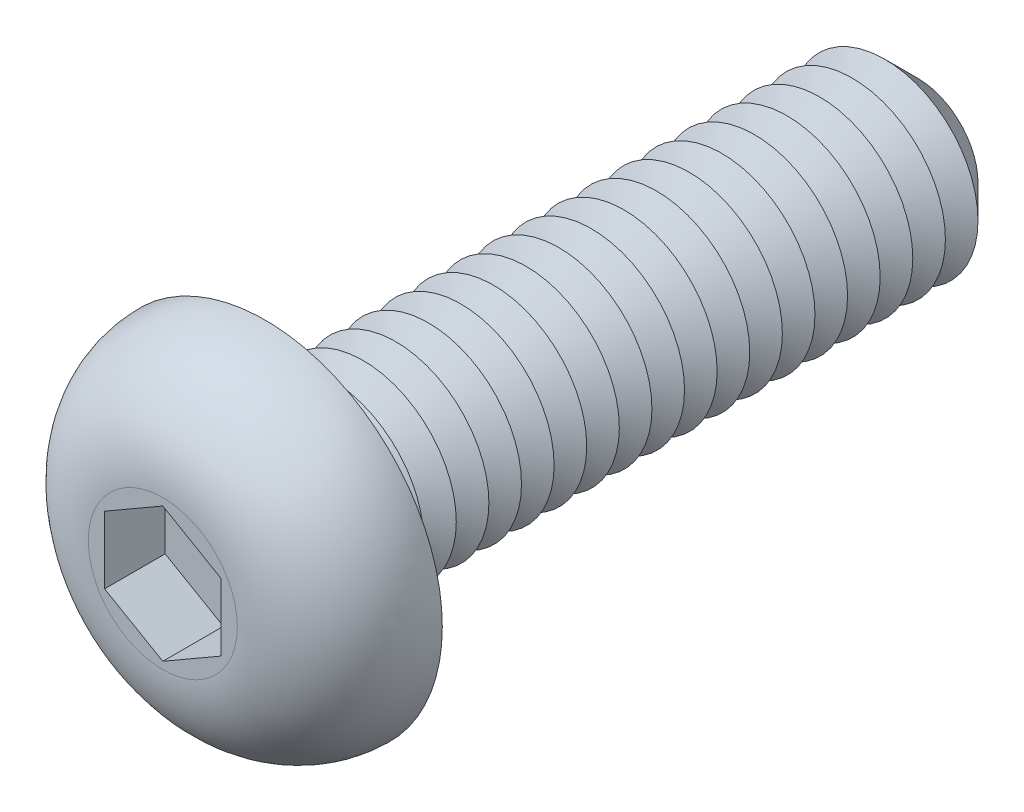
ISO-10303-21;
HEADER;
FILE_DESCRIPTION(('STEP AP214'),'2;1');
FILE_NAME('part.step','',(''),(''),'','','');
FILE_SCHEMA(('AUTOMOTIVE_DESIGN { 1 0 10303 214 1 1 1 1 }'));
ENDSEC;
DATA;
#1=APPLICATION_CONTEXT('core data for automotive mechanical design processes');
#2=APPLICATION_PROTOCOL_DEFINITION('international standard','automotive_design',2000,#1);
#3=PRODUCT_CONTEXT('',#1,'mechanical');
#4=PRODUCT('Part','Part','',(#3));
#5=PRODUCT_RELATED_PRODUCT_CATEGORY('part','',(#4));
#6=PRODUCT_DEFINITION_FORMATION('','',#4);
#7=PRODUCT_DEFINITION_CONTEXT('part definition',#1,'design');
#8=PRODUCT_DEFINITION('design','',#6,#7);
#9=PRODUCT_DEFINITION_SHAPE('','',#8);
#10=(LENGTH_UNIT() NAMED_UNIT(*) SI_UNIT(.MILLI.,.METRE.));
#11=(NAMED_UNIT(*) PLANE_ANGLE_UNIT() SI_UNIT($,.RADIAN.));
#12=(NAMED_UNIT(*) SI_UNIT($,.STERADIAN.) SOLID_ANGLE_UNIT());
#13=UNCERTAINTY_MEASURE_WITH_UNIT(LENGTH_MEASURE(1.E-05),#10,'distance_accuracy_value','');
#14=(GEOMETRIC_REPRESENTATION_CONTEXT(3) GLOBAL_UNCERTAINTY_ASSIGNED_CONTEXT((#13)) GLOBAL_UNIT_ASSIGNED_CONTEXT((#10,
#11,#12)) REPRESENTATION_CONTEXT('',''));
#15=CARTESIAN_POINT('',(0.,0.,0.));
#16=DIRECTION('',(0.,0.,1.));
#17=DIRECTION('',(1.,0.,0.));
#18=AXIS2_PLACEMENT_3D('',#15,#16,#17);
#19=CARTESIAN_POINT('',(0.,0.,-14.));
#20=DIRECTION('',(0.,0.,1.));
#21=DIRECTION('',(1.,0.,0.));
#22=AXIS2_PLACEMENT_3D('',#19,#20,#21);
#23=CYLINDRICAL_SURFACE('',#22,2.);
#24=CARTESIAN_POINT('',(0.,0.,-0.35));
#25=DIRECTION('',(0.,0.,1.));
#26=DIRECTION('',(1.,0.,0.));
#27=AXIS2_PLACEMENT_3D('',#24,#25,#26);
#28=CIRCLE('',#27,2.);
#29=CARTESIAN_POINT('',(2.,0.,-0.35));
#30=VERTEX_POINT('',#29);
#31=EDGE_CURVE('E48',#30,#30,#28,.F.);
#32=ORIENTED_EDGE('',*,*,#31,.T.);
#33=EDGE_LOOP('',(#32));
#34=FACE_BOUND('',#33,.T.);
#35=CARTESIAN_POINT('',(0.,0.,-0.699999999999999));
#36=DIRECTION('',(0.,0.,1.));
#37=DIRECTION('',(1.,0.,0.));
#38=AXIS2_PLACEMENT_3D('',#35,#36,#37);
#39=CIRCLE('',#38,2.);
#40=CARTESIAN_POINT('',(2.,0.,-0.699999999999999));
#41=VERTEX_POINT('',#40);
#42=EDGE_CURVE('E138',#41,#41,#39,.T.);
#43=ORIENTED_EDGE('',*,*,#42,.T.);
#44=EDGE_LOOP('',(#43));
#45=FACE_BOUND('',#44,.T.);
#46=ADVANCED_FACE('F39',(#34,#45),#23,.T.);
#47=CARTESIAN_POINT('',(0.,3.8,0.));
#48=DIRECTION('',(0.,0.,1.));
#49=DIRECTION('',(1.,0.,0.));
#50=AXIS2_PLACEMENT_3D('',#47,#48,#49);
#51=PLANE('',#50);
#52=CARTESIAN_POINT('',(0.,0.,0.));
#53=DIRECTION('',(0.,0.,1.));
#54=DIRECTION('',(1.,0.,0.));
#55=AXIS2_PLACEMENT_3D('',#52,#53,#54);
#56=CIRCLE('',#55,2.35);
#57=CARTESIAN_POINT('',(2.35,0.,0.));
#58=VERTEX_POINT('',#57);
#59=EDGE_CURVE('E11',#58,#58,#56,.T.);
#60=ORIENTED_EDGE('',*,*,#59,.T.);
#61=EDGE_LOOP('',(#60));
#62=FACE_BOUND('',#61,.T.);
#63=CARTESIAN_POINT('',(0.,0.,0.));
#64=DIRECTION('',(0.,0.,1.));
#65=DIRECTION('',(1.,0.,0.));
#66=AXIS2_PLACEMENT_3D('',#63,#64,#65);
#67=CIRCLE('',#66,3.8);
#68=CARTESIAN_POINT('',(3.8,0.,0.));
#69=VERTEX_POINT('',#68);
#70=EDGE_CURVE('E156',#69,#69,#67,.T.);
#71=ORIENTED_EDGE('',*,*,#70,.F.);
#72=EDGE_LOOP('',(#71));
#73=FACE_BOUND('',#72,.T.);
#74=ADVANCED_FACE('F198',(#62,#73),#51,.F.);
#75=CARTESIAN_POINT('',(0.,0.,2.2));
#76=DIRECTION('',(0.,0.,-1.));
#77=DIRECTION('',(-1.,0.,0.));
#78=AXIS2_PLACEMENT_3D('',#75,#76,#77);
#79=PLANE('',#78);
#80=DIRECTION('',(-0.866025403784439,-0.5,0.));
#81=VECTOR('',#80,1.);
#82=CARTESIAN_POINT('',(0.,1.44337567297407,2.2));
#83=LINE('',#82,#81);
#84=CARTESIAN_POINT('',(0.,1.44337567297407,2.2));
#85=VERTEX_POINT('',#84);
#86=CARTESIAN_POINT('',(-1.25,0.721687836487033,2.2));
#87=VERTEX_POINT('',#86);
#88=EDGE_CURVE('E137',#85,#87,#83,.T.);
#89=ORIENTED_EDGE('',*,*,#88,.F.);
#90=DIRECTION('',(-0.866025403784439,0.5,0.));
#91=VECTOR('',#90,1.);
#92=CARTESIAN_POINT('',(1.25,0.721687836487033,2.2));
#93=LINE('',#92,#91);
#94=CARTESIAN_POINT('',(1.25,0.721687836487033,2.2));
#95=VERTEX_POINT('',#94);
#96=EDGE_CURVE('E55',#95,#85,#93,.T.);
#97=ORIENTED_EDGE('',*,*,#96,.F.);
#98=DIRECTION('',(0.,1.,0.));
#99=VECTOR('',#98,1.);
#100=CARTESIAN_POINT('',(1.25,-0.721687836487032,2.2));
#101=LINE('',#100,#99);
#102=CARTESIAN_POINT('',(1.25,-0.721687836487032,2.2));
#103=VERTEX_POINT('',#102);
#104=EDGE_CURVE('E150',#103,#95,#101,.T.);
#105=ORIENTED_EDGE('',*,*,#104,.F.);
#106=DIRECTION('',(0.866025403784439,0.5,0.));
#107=VECTOR('',#106,1.);
#108=CARTESIAN_POINT('',(0.,-1.44337567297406,2.2));
#109=LINE('',#108,#107);
#110=CARTESIAN_POINT('',(0.,-1.44337567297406,2.2));
#111=VERTEX_POINT('',#110);
#112=EDGE_CURVE('E147',#111,#103,#109,.T.);
#113=ORIENTED_EDGE('',*,*,#112,.F.);
#114=DIRECTION('',(0.866025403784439,-0.5,0.));
#115=VECTOR('',#114,1.);
#116=CARTESIAN_POINT('',(-1.25,-0.721687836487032,2.2));
#117=LINE('',#116,#115);
#118=CARTESIAN_POINT('',(-1.25,-0.721687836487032,2.2));
#119=VERTEX_POINT('',#118);
#120=EDGE_CURVE('E103',#119,#111,#117,.T.);
#121=ORIENTED_EDGE('',*,*,#120,.F.);
#122=DIRECTION('',(0.,-1.,0.));
#123=VECTOR('',#122,1.);
#124=CARTESIAN_POINT('',(-1.25,0.721687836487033,2.2));
#125=LINE('',#124,#123);
#126=EDGE_CURVE('E141',#87,#119,#125,.T.);
#127=ORIENTED_EDGE('',*,*,#126,.F.);
#128=EDGE_LOOP('',(#89,#97,#105,#113,#121,#127));
#129=FACE_BOUND('',#128,.T.);
#130=CARTESIAN_POINT('',(0.,0.,2.2));
#131=DIRECTION('',(0.,0.,1.));
#132=DIRECTION('',(1.,0.,0.));
#133=AXIS2_PLACEMENT_3D('',#130,#131,#132);
#134=CIRCLE('',#133,1.6);
#135=CARTESIAN_POINT('',(1.6,0.,2.2));
#136=VERTEX_POINT('',#135);
#137=EDGE_CURVE('E169',#136,#136,#134,.T.);
#138=ORIENTED_EDGE('',*,*,#137,.T.);
#139=EDGE_LOOP('',(#138));
#140=FACE_BOUND('',#139,.T.);
#141=ADVANCED_FACE('F203',(#129,#140),#79,.F.);
#142=CARTESIAN_POINT('',(0.,0.,0.));
#143=DIRECTION('',(0.,0.,1.));
#144=DIRECTION('',(1.,0.,0.));
#145=AXIS2_PLACEMENT_3D('',#142,#143,#144);
#146=DEGENERATE_TOROIDAL_SURFACE('',#145,1.6,2.2,.T.);
#147=ORIENTED_EDGE('',*,*,#137,.F.);
#148=EDGE_LOOP('',(#147));
#149=FACE_BOUND('',#148,.T.);
#150=ORIENTED_EDGE('',*,*,#70,.T.);
#151=EDGE_LOOP('',(#150));
#152=FACE_BOUND('',#151,.T.);
#153=ADVANCED_FACE('F231',(#149,#152),#146,.T.);
#154=CARTESIAN_POINT('',(1.25,0.721687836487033,0.9));
#155=DIRECTION('',(0.5,0.866025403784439,0.));
#156=DIRECTION('',(-0.866025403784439,0.5,0.));
#157=AXIS2_PLACEMENT_3D('',#154,#155,#156);
#158=PLANE('',#157);
#159=ORIENTED_EDGE('',*,*,#96,.T.);
#160=DIRECTION('',(0.,0.,1.));
#161=VECTOR('',#160,1.);
#162=CARTESIAN_POINT('',(0.,1.44337567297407,0.9));
#163=LINE('',#162,#161);
#164=CARTESIAN_POINT('',(0.,1.44337567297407,0.9));
#165=VERTEX_POINT('',#164);
#166=EDGE_CURVE('E85',#165,#85,#163,.T.);
#167=ORIENTED_EDGE('',*,*,#166,.F.);
#168=DIRECTION('',(-0.866025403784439,0.5,0.));
#169=VECTOR('',#168,1.);
#170=CARTESIAN_POINT('',(1.25,0.721687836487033,0.9));
#171=LINE('',#170,#169);
#172=CARTESIAN_POINT('',(1.25,0.721687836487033,0.9));
#173=VERTEX_POINT('',#172);
#174=EDGE_CURVE('E153',#173,#165,#171,.T.);
#175=ORIENTED_EDGE('',*,*,#174,.F.);
#176=DIRECTION('',(0.,0.,1.));
#177=VECTOR('',#176,1.);
#178=CARTESIAN_POINT('',(1.25,0.721687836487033,0.9));
#179=LINE('',#178,#177);
#180=EDGE_CURVE('E63',#173,#95,#179,.T.);
#181=ORIENTED_EDGE('',*,*,#180,.T.);
#182=EDGE_LOOP('',(#159,#167,#175,#181));
#183=FACE_BOUND('',#182,.T.);
#184=ADVANCED_FACE('F217',(#183),#158,.F.);
#185=CARTESIAN_POINT('',(1.25,-0.721687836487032,0.9));
#186=DIRECTION('',(1.,0.,0.));
#187=DIRECTION('',(0.,1.,0.));
#188=AXIS2_PLACEMENT_3D('',#185,#186,#187);
#189=PLANE('',#188);
#190=ORIENTED_EDGE('',*,*,#104,.T.);
#191=ORIENTED_EDGE('',*,*,#180,.F.);
#192=DIRECTION('',(0.,1.,0.));
#193=VECTOR('',#192,1.);
#194=CARTESIAN_POINT('',(1.25,-0.721687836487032,0.9));
#195=LINE('',#194,#193);
#196=CARTESIAN_POINT('',(1.25,-0.721687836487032,0.9));
#197=VERTEX_POINT('',#196);
#198=EDGE_CURVE('E117',#197,#173,#195,.T.);
#199=ORIENTED_EDGE('',*,*,#198,.F.);
#200=DIRECTION('',(0.,0.,1.));
#201=VECTOR('',#200,1.);
#202=CARTESIAN_POINT('',(1.25,-0.721687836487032,0.9));
#203=LINE('',#202,#201);
#204=EDGE_CURVE('E108',#197,#103,#203,.T.);
#205=ORIENTED_EDGE('',*,*,#204,.T.);
#206=EDGE_LOOP('',(#190,#191,#199,#205));
#207=FACE_BOUND('',#206,.T.);
#208=ADVANCED_FACE('F214',(#207),#189,.F.);
#209=CARTESIAN_POINT('',(0.,-1.44337567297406,0.9));
#210=DIRECTION('',(0.5,-0.866025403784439,0.));
#211=DIRECTION('',(0.866025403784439,0.5,0.));
#212=AXIS2_PLACEMENT_3D('',#209,#210,#211);
#213=PLANE('',#212);
#214=ORIENTED_EDGE('',*,*,#112,.T.);
#215=ORIENTED_EDGE('',*,*,#204,.F.);
#216=DIRECTION('',(0.866025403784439,0.5,0.));
#217=VECTOR('',#216,1.);
#218=CARTESIAN_POINT('',(0.,-1.44337567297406,0.9));
#219=LINE('',#218,#217);
#220=CARTESIAN_POINT('',(0.,-1.44337567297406,0.9));
#221=VERTEX_POINT('',#220);
#222=EDGE_CURVE('E112',#221,#197,#219,.T.);
#223=ORIENTED_EDGE('',*,*,#222,.F.);
#224=DIRECTION('',(0.,0.,1.));
#225=VECTOR('',#224,1.);
#226=CARTESIAN_POINT('',(0.,-1.44337567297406,0.9));
#227=LINE('',#226,#225);
#228=EDGE_CURVE('E96',#221,#111,#227,.T.);
#229=ORIENTED_EDGE('',*,*,#228,.T.);
#230=EDGE_LOOP('',(#214,#215,#223,#229));
#231=FACE_BOUND('',#230,.T.);
#232=ADVANCED_FACE('F113',(#231),#213,.F.);
#233=CARTESIAN_POINT('',(-1.25,-0.721687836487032,0.9));
#234=DIRECTION('',(-0.5,-0.866025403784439,0.));
#235=DIRECTION('',(0.866025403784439,-0.5,0.));
#236=AXIS2_PLACEMENT_3D('',#233,#234,#235);
#237=PLANE('',#236);
#238=ORIENTED_EDGE('',*,*,#120,.T.);
#239=ORIENTED_EDGE('',*,*,#228,.F.);
#240=DIRECTION('',(0.866025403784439,-0.5,0.));
#241=VECTOR('',#240,1.);
#242=CARTESIAN_POINT('',(-1.25,-0.721687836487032,0.9));
#243=LINE('',#242,#241);
#244=CARTESIAN_POINT('',(-1.25,-0.721687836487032,0.9));
#245=VERTEX_POINT('',#244);
#246=EDGE_CURVE('E100',#245,#221,#243,.T.);
#247=ORIENTED_EDGE('',*,*,#246,.F.);
#248=DIRECTION('',(0.,0.,1.));
#249=VECTOR('',#248,1.);
#250=CARTESIAN_POINT('',(-1.25,-0.721687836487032,0.9));
#251=LINE('',#250,#249);
#252=EDGE_CURVE('E109',#245,#119,#251,.T.);
#253=ORIENTED_EDGE('',*,*,#252,.T.);
#254=EDGE_LOOP('',(#238,#239,#247,#253));
#255=FACE_BOUND('',#254,.T.);
#256=ADVANCED_FACE('F98',(#255),#237,.F.);
#257=CARTESIAN_POINT('',(-1.25,0.721687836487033,0.9));
#258=DIRECTION('',(-1.,0.,0.));
#259=DIRECTION('',(0.,-1.,0.));
#260=AXIS2_PLACEMENT_3D('',#257,#258,#259);
#261=PLANE('',#260);
#262=ORIENTED_EDGE('',*,*,#126,.T.);
#263=ORIENTED_EDGE('',*,*,#252,.F.);
#264=DIRECTION('',(0.,-1.,0.));
#265=VECTOR('',#264,1.);
#266=CARTESIAN_POINT('',(-1.25,0.721687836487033,0.9));
#267=LINE('',#266,#265);
#268=CARTESIAN_POINT('',(-1.25,0.721687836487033,0.9));
#269=VERTEX_POINT('',#268);
#270=EDGE_CURVE('E123',#269,#245,#267,.T.);
#271=ORIENTED_EDGE('',*,*,#270,.F.);
#272=DIRECTION('',(0.,0.,1.));
#273=VECTOR('',#272,1.);
#274=CARTESIAN_POINT('',(-1.25,0.721687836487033,0.9));
#275=LINE('',#274,#273);
#276=EDGE_CURVE('E161',#269,#87,#275,.T.);
#277=ORIENTED_EDGE('',*,*,#276,.T.);
#278=EDGE_LOOP('',(#262,#263,#271,#277));
#279=FACE_BOUND('',#278,.T.);
#280=ADVANCED_FACE('F222',(#279),#261,.F.);
#281=CARTESIAN_POINT('',(0.,1.44337567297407,0.9));
#282=DIRECTION('',(-0.5,0.866025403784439,0.));
#283=DIRECTION('',(-0.866025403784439,-0.5,0.));
#284=AXIS2_PLACEMENT_3D('',#281,#282,#283);
#285=PLANE('',#284);
#286=ORIENTED_EDGE('',*,*,#88,.T.);
#287=ORIENTED_EDGE('',*,*,#276,.F.);
#288=DIRECTION('',(-0.866025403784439,-0.5,0.));
#289=VECTOR('',#288,1.);
#290=CARTESIAN_POINT('',(0.,1.44337567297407,0.9));
#291=LINE('',#290,#289);
#292=EDGE_CURVE('E129',#165,#269,#291,.T.);
#293=ORIENTED_EDGE('',*,*,#292,.F.);
#294=ORIENTED_EDGE('',*,*,#166,.T.);
#295=EDGE_LOOP('',(#286,#287,#293,#294));
#296=FACE_BOUND('',#295,.T.);
#297=ADVANCED_FACE('F212',(#296),#285,.F.);
#298=CARTESIAN_POINT('',(0.,0.,0.9));
#299=DIRECTION('',(0.,0.,1.));
#300=DIRECTION('',(1.,0.,0.));
#301=AXIS2_PLACEMENT_3D('',#298,#299,#300);
#302=PLANE('',#301);
#303=CARTESIAN_POINT('',(0.,0.,0.9));
#304=DIRECTION('',(0.,0.,1.));
#305=DIRECTION('',(1.,0.,0.));
#306=AXIS2_PLACEMENT_3D('',#303,#304,#305);
#307=CIRCLE('',#306,0.5);
#308=CARTESIAN_POINT('',(0.5,0.,0.9));
#309=VERTEX_POINT('',#308);
#310=EDGE_CURVE('E399',#309,#309,#307,.T.);
#311=ORIENTED_EDGE('',*,*,#310,.F.);
#312=EDGE_LOOP('',(#311));
#313=FACE_BOUND('',#312,.T.);
#314=ORIENTED_EDGE('',*,*,#174,.T.);
#315=ORIENTED_EDGE('',*,*,#292,.T.);
#316=ORIENTED_EDGE('',*,*,#270,.T.);
#317=ORIENTED_EDGE('',*,*,#246,.T.);
#318=ORIENTED_EDGE('',*,*,#222,.T.);
#319=ORIENTED_EDGE('',*,*,#198,.T.);
#320=EDGE_LOOP('',(#314,#315,#316,#317,#318,#319));
#321=FACE_BOUND('',#320,.T.);
#322=ADVANCED_FACE('F120',(#313,#321),#302,.T.);
#323=CARTESIAN_POINT('',(0.,0.,-0.699999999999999));
#324=DIRECTION('',(0.,0.,1.));
#325=DIRECTION('',(1.,0.,0.));
#326=AXIS2_PLACEMENT_3D('',#323,#324,#325);
#327=CONICAL_SURFACE('',#326,2.,1.04719755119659);
#328=CARTESIAN_POINT('',(0.,0.,-1.05));
#329=DIRECTION('',(0.,0.,1.));
#330=DIRECTION('',(1.,0.,0.));
#331=AXIS2_PLACEMENT_3D('',#328,#329,#330);
#332=CIRCLE('',#331,1.39378221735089);
#333=CARTESIAN_POINT('',(1.39378221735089,0.,-1.05));
#334=VERTEX_POINT('',#333);
#335=EDGE_CURVE('E256',#334,#334,#332,.T.);
#336=ORIENTED_EDGE('',*,*,#335,.T.);
#337=EDGE_LOOP('',(#336));
#338=FACE_BOUND('',#337,.T.);
#339=ORIENTED_EDGE('',*,*,#42,.F.);
#340=EDGE_LOOP('',(#339));
#341=FACE_BOUND('',#340,.T.);
#342=ADVANCED_FACE('F211',(#338,#341),#327,.T.);
#343=CARTESIAN_POINT('',(0.,0.,-1.05));
#344=DIRECTION('',(0.,0.,-1.));
#345=DIRECTION('',(-1.,0.,0.));
#346=AXIS2_PLACEMENT_3D('',#343,#344,#345);
#347=CONICAL_SURFACE('',#346,1.39378221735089,1.0471975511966);
#348=CARTESIAN_POINT('',(0.,0.,-1.4));
#349=DIRECTION('',(0.,0.,1.));
#350=DIRECTION('',(1.,0.,0.));
#351=AXIS2_PLACEMENT_3D('',#348,#349,#350);
#352=CIRCLE('',#351,2.);
#353=CARTESIAN_POINT('',(2.,0.,-1.4));
#354=VERTEX_POINT('',#353);
#355=EDGE_CURVE('E260',#354,#354,#352,.T.);
#356=ORIENTED_EDGE('',*,*,#355,.T.);
#357=EDGE_LOOP('',(#356));
#358=FACE_BOUND('',#357,.T.);
#359=ORIENTED_EDGE('',*,*,#335,.F.);
#360=EDGE_LOOP('',(#359));
#361=FACE_BOUND('',#360,.T.);
#362=ADVANCED_FACE('F551',(#358,#361),#347,.T.);
#363=CARTESIAN_POINT('',(0.,0.,-1.4));
#364=DIRECTION('',(0.,0.,1.));
#365=DIRECTION('',(1.,0.,0.));
#366=AXIS2_PLACEMENT_3D('',#363,#364,#365);
#367=CONICAL_SURFACE('',#366,2.,1.04719755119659);
#368=CARTESIAN_POINT('',(0.,0.,-1.75));
#369=DIRECTION('',(0.,0.,1.));
#370=DIRECTION('',(1.,0.,0.));
#371=AXIS2_PLACEMENT_3D('',#368,#369,#370);
#372=CIRCLE('',#371,1.39378221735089);
#373=CARTESIAN_POINT('',(1.39378221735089,0.,-1.75));
#374=VERTEX_POINT('',#373);
#375=EDGE_CURVE('E264',#374,#374,#372,.T.);
#376=ORIENTED_EDGE('',*,*,#375,.T.);
#377=EDGE_LOOP('',(#376));
#378=FACE_BOUND('',#377,.T.);
#379=ORIENTED_EDGE('',*,*,#355,.F.);
#380=EDGE_LOOP('',(#379));
#381=FACE_BOUND('',#380,.T.);
#382=ADVANCED_FACE('F547',(#378,#381),#367,.T.);
#383=CARTESIAN_POINT('',(0.,0.,-1.75));
#384=DIRECTION('',(0.,0.,-1.));
#385=DIRECTION('',(-1.,0.,0.));
#386=AXIS2_PLACEMENT_3D('',#383,#384,#385);
#387=CONICAL_SURFACE('',#386,1.39378221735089,1.0471975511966);
#388=CARTESIAN_POINT('',(0.,0.,-2.1));
#389=DIRECTION('',(0.,0.,1.));
#390=DIRECTION('',(1.,0.,0.));
#391=AXIS2_PLACEMENT_3D('',#388,#389,#390);
#392=CIRCLE('',#391,2.);
#393=CARTESIAN_POINT('',(2.,0.,-2.1));
#394=VERTEX_POINT('',#393);
#395=EDGE_CURVE('E268',#394,#394,#392,.T.);
#396=ORIENTED_EDGE('',*,*,#395,.T.);
#397=EDGE_LOOP('',(#396));
#398=FACE_BOUND('',#397,.T.);
#399=ORIENTED_EDGE('',*,*,#375,.F.);
#400=EDGE_LOOP('',(#399));
#401=FACE_BOUND('',#400,.T.);
#402=ADVANCED_FACE('F543',(#398,#401),#387,.T.);
#403=CARTESIAN_POINT('',(0.,0.,-2.1));
#404=DIRECTION('',(0.,0.,1.));
#405=DIRECTION('',(1.,0.,0.));
#406=AXIS2_PLACEMENT_3D('',#403,#404,#405);
#407=CONICAL_SURFACE('',#406,2.,1.04719755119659);
#408=CARTESIAN_POINT('',(0.,0.,-2.45));
#409=DIRECTION('',(0.,0.,1.));
#410=DIRECTION('',(1.,0.,0.));
#411=AXIS2_PLACEMENT_3D('',#408,#409,#410);
#412=CIRCLE('',#411,1.39378221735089);
#413=CARTESIAN_POINT('',(1.39378221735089,0.,-2.45));
#414=VERTEX_POINT('',#413);
#415=EDGE_CURVE('E271',#414,#414,#412,.T.);
#416=ORIENTED_EDGE('',*,*,#415,.T.);
#417=EDGE_LOOP('',(#416));
#418=FACE_BOUND('',#417,.T.);
#419=ORIENTED_EDGE('',*,*,#395,.F.);
#420=EDGE_LOOP('',(#419));
#421=FACE_BOUND('',#420,.T.);
#422=ADVANCED_FACE('F539',(#418,#421),#407,.T.);
#423=CARTESIAN_POINT('',(0.,0.,-2.45));
#424=DIRECTION('',(0.,0.,-1.));
#425=DIRECTION('',(-1.,0.,0.));
#426=AXIS2_PLACEMENT_3D('',#423,#424,#425);
#427=CONICAL_SURFACE('',#426,1.39378221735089,1.0471975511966);
#428=CARTESIAN_POINT('',(0.,0.,-2.8));
#429=DIRECTION('',(0.,0.,1.));
#430=DIRECTION('',(1.,0.,0.));
#431=AXIS2_PLACEMENT_3D('',#428,#429,#430);
#432=CIRCLE('',#431,2.);
#433=CARTESIAN_POINT('',(2.,0.,-2.8));
#434=VERTEX_POINT('',#433);
#435=EDGE_CURVE('E275',#434,#434,#432,.T.);
#436=ORIENTED_EDGE('',*,*,#435,.T.);
#437=EDGE_LOOP('',(#436));
#438=FACE_BOUND('',#437,.T.);
#439=ORIENTED_EDGE('',*,*,#415,.F.);
#440=EDGE_LOOP('',(#439));
#441=FACE_BOUND('',#440,.T.);
#442=ADVANCED_FACE('F535',(#438,#441),#427,.T.);
#443=CARTESIAN_POINT('',(0.,0.,-2.8));
#444=DIRECTION('',(0.,0.,1.));
#445=DIRECTION('',(1.,0.,0.));
#446=AXIS2_PLACEMENT_3D('',#443,#444,#445);
#447=CONICAL_SURFACE('',#446,2.,1.04719755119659);
#448=CARTESIAN_POINT('',(0.,0.,-3.15));
#449=DIRECTION('',(0.,0.,1.));
#450=DIRECTION('',(1.,0.,0.));
#451=AXIS2_PLACEMENT_3D('',#448,#449,#450);
#452=CIRCLE('',#451,1.39378221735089);
#453=CARTESIAN_POINT('',(1.39378221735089,0.,-3.15));
#454=VERTEX_POINT('',#453);
#455=EDGE_CURVE('E279',#454,#454,#452,.T.);
#456=ORIENTED_EDGE('',*,*,#455,.T.);
#457=EDGE_LOOP('',(#456));
#458=FACE_BOUND('',#457,.T.);
#459=ORIENTED_EDGE('',*,*,#435,.F.);
#460=EDGE_LOOP('',(#459));
#461=FACE_BOUND('',#460,.T.);
#462=ADVANCED_FACE('F531',(#458,#461),#447,.T.);
#463=CARTESIAN_POINT('',(0.,0.,-3.15));
#464=DIRECTION('',(0.,0.,-1.));
#465=DIRECTION('',(-1.,0.,0.));
#466=AXIS2_PLACEMENT_3D('',#463,#464,#465);
#467=CONICAL_SURFACE('',#466,1.39378221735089,1.0471975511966);
#468=CARTESIAN_POINT('',(0.,0.,-3.5));
#469=DIRECTION('',(0.,0.,1.));
#470=DIRECTION('',(1.,0.,0.));
#471=AXIS2_PLACEMENT_3D('',#468,#469,#470);
#472=CIRCLE('',#471,2.);
#473=CARTESIAN_POINT('',(2.,0.,-3.5));
#474=VERTEX_POINT('',#473);
#475=EDGE_CURVE('E282',#474,#474,#472,.T.);
#476=ORIENTED_EDGE('',*,*,#475,.T.);
#477=EDGE_LOOP('',(#476));
#478=FACE_BOUND('',#477,.T.);
#479=ORIENTED_EDGE('',*,*,#455,.F.);
#480=EDGE_LOOP('',(#479));
#481=FACE_BOUND('',#480,.T.);
#482=ADVANCED_FACE('F527',(#478,#481),#467,.T.);
#483=CARTESIAN_POINT('',(0.,0.,-3.5));
#484=DIRECTION('',(0.,0.,1.));
#485=DIRECTION('',(1.,0.,0.));
#486=AXIS2_PLACEMENT_3D('',#483,#484,#485);
#487=CONICAL_SURFACE('',#486,2.,1.04719755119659);
#488=CARTESIAN_POINT('',(0.,0.,-3.85));
#489=DIRECTION('',(0.,0.,1.));
#490=DIRECTION('',(1.,0.,0.));
#491=AXIS2_PLACEMENT_3D('',#488,#489,#490);
#492=CIRCLE('',#491,1.39378221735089);
#493=CARTESIAN_POINT('',(1.39378221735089,0.,-3.85));
#494=VERTEX_POINT('',#493);
#495=EDGE_CURVE('E286',#494,#494,#492,.T.);
#496=ORIENTED_EDGE('',*,*,#495,.T.);
#497=EDGE_LOOP('',(#496));
#498=FACE_BOUND('',#497,.T.);
#499=ORIENTED_EDGE('',*,*,#475,.F.);
#500=EDGE_LOOP('',(#499));
#501=FACE_BOUND('',#500,.T.);
#502=ADVANCED_FACE('F523',(#498,#501),#487,.T.);
#503=CARTESIAN_POINT('',(0.,0.,-3.85));
#504=DIRECTION('',(0.,0.,-1.));
#505=DIRECTION('',(-1.,0.,0.));
#506=AXIS2_PLACEMENT_3D('',#503,#504,#505);
#507=CONICAL_SURFACE('',#506,1.39378221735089,1.0471975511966);
#508=CARTESIAN_POINT('',(0.,0.,-4.2));
#509=DIRECTION('',(0.,0.,1.));
#510=DIRECTION('',(1.,0.,0.));
#511=AXIS2_PLACEMENT_3D('',#508,#509,#510);
#512=CIRCLE('',#511,2.);
#513=CARTESIAN_POINT('',(2.,0.,-4.2));
#514=VERTEX_POINT('',#513);
#515=EDGE_CURVE('E290',#514,#514,#512,.T.);
#516=ORIENTED_EDGE('',*,*,#515,.T.);
#517=EDGE_LOOP('',(#516));
#518=FACE_BOUND('',#517,.T.);
#519=ORIENTED_EDGE('',*,*,#495,.F.);
#520=EDGE_LOOP('',(#519));
#521=FACE_BOUND('',#520,.T.);
#522=ADVANCED_FACE('F519',(#518,#521),#507,.T.);
#523=CARTESIAN_POINT('',(0.,0.,-4.2));
#524=DIRECTION('',(0.,0.,1.));
#525=DIRECTION('',(1.,0.,0.));
#526=AXIS2_PLACEMENT_3D('',#523,#524,#525);
#527=CONICAL_SURFACE('',#526,2.,1.04719755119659);
#528=CARTESIAN_POINT('',(0.,0.,-4.55));
#529=DIRECTION('',(0.,0.,1.));
#530=DIRECTION('',(1.,0.,0.));
#531=AXIS2_PLACEMENT_3D('',#528,#529,#530);
#532=CIRCLE('',#531,1.39378221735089);
#533=CARTESIAN_POINT('',(1.39378221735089,0.,-4.55));
#534=VERTEX_POINT('',#533);
#535=EDGE_CURVE('E294',#534,#534,#532,.T.);
#536=ORIENTED_EDGE('',*,*,#535,.T.);
#537=EDGE_LOOP('',(#536));
#538=FACE_BOUND('',#537,.T.);
#539=ORIENTED_EDGE('',*,*,#515,.F.);
#540=EDGE_LOOP('',(#539));
#541=FACE_BOUND('',#540,.T.);
#542=ADVANCED_FACE('F515',(#538,#541),#527,.T.);
#543=CARTESIAN_POINT('',(0.,0.,-4.55));
#544=DIRECTION('',(0.,0.,-1.));
#545=DIRECTION('',(-1.,0.,0.));
#546=AXIS2_PLACEMENT_3D('',#543,#544,#545);
#547=CONICAL_SURFACE('',#546,1.39378221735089,1.0471975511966);
#548=CARTESIAN_POINT('',(0.,0.,-4.9));
#549=DIRECTION('',(0.,0.,1.));
#550=DIRECTION('',(1.,0.,0.));
#551=AXIS2_PLACEMENT_3D('',#548,#549,#550);
#552=CIRCLE('',#551,2.);
#553=CARTESIAN_POINT('',(2.,0.,-4.9));
#554=VERTEX_POINT('',#553);
#555=EDGE_CURVE('E298',#554,#554,#552,.T.);
#556=ORIENTED_EDGE('',*,*,#555,.T.);
#557=EDGE_LOOP('',(#556));
#558=FACE_BOUND('',#557,.T.);
#559=ORIENTED_EDGE('',*,*,#535,.F.);
#560=EDGE_LOOP('',(#559));
#561=FACE_BOUND('',#560,.T.);
#562=ADVANCED_FACE('F511',(#558,#561),#547,.T.);
#563=CARTESIAN_POINT('',(0.,0.,-4.9));
#564=DIRECTION('',(0.,0.,1.));
#565=DIRECTION('',(1.,0.,0.));
#566=AXIS2_PLACEMENT_3D('',#563,#564,#565);
#567=CONICAL_SURFACE('',#566,2.,1.04719755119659);
#568=CARTESIAN_POINT('',(0.,0.,-5.25));
#569=DIRECTION('',(0.,0.,1.));
#570=DIRECTION('',(1.,0.,0.));
#571=AXIS2_PLACEMENT_3D('',#568,#569,#570);
#572=CIRCLE('',#571,1.39378221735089);
#573=CARTESIAN_POINT('',(1.39378221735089,0.,-5.25));
#574=VERTEX_POINT('',#573);
#575=EDGE_CURVE('E302',#574,#574,#572,.T.);
#576=ORIENTED_EDGE('',*,*,#575,.T.);
#577=EDGE_LOOP('',(#576));
#578=FACE_BOUND('',#577,.T.);
#579=ORIENTED_EDGE('',*,*,#555,.F.);
#580=EDGE_LOOP('',(#579));
#581=FACE_BOUND('',#580,.T.);
#582=ADVANCED_FACE('F507',(#578,#581),#567,.T.);
#583=CARTESIAN_POINT('',(0.,0.,-5.25));
#584=DIRECTION('',(0.,0.,-1.));
#585=DIRECTION('',(-1.,0.,0.));
#586=AXIS2_PLACEMENT_3D('',#583,#584,#585);
#587=CONICAL_SURFACE('',#586,1.39378221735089,1.0471975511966);
#588=CARTESIAN_POINT('',(0.,0.,-5.6));
#589=DIRECTION('',(0.,0.,1.));
#590=DIRECTION('',(1.,0.,0.));
#591=AXIS2_PLACEMENT_3D('',#588,#589,#590);
#592=CIRCLE('',#591,2.);
#593=CARTESIAN_POINT('',(2.,0.,-5.6));
#594=VERTEX_POINT('',#593);
#595=EDGE_CURVE('E306',#594,#594,#592,.T.);
#596=ORIENTED_EDGE('',*,*,#595,.T.);
#597=EDGE_LOOP('',(#596));
#598=FACE_BOUND('',#597,.T.);
#599=ORIENTED_EDGE('',*,*,#575,.F.);
#600=EDGE_LOOP('',(#599));
#601=FACE_BOUND('',#600,.T.);
#602=ADVANCED_FACE('F503',(#598,#601),#587,.T.);
#603=CARTESIAN_POINT('',(0.,0.,-5.6));
#604=DIRECTION('',(0.,0.,1.));
#605=DIRECTION('',(1.,0.,0.));
#606=AXIS2_PLACEMENT_3D('',#603,#604,#605);
#607=CONICAL_SURFACE('',#606,2.,1.04719755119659);
#608=CARTESIAN_POINT('',(0.,0.,-5.95));
#609=DIRECTION('',(0.,0.,1.));
#610=DIRECTION('',(1.,0.,0.));
#611=AXIS2_PLACEMENT_3D('',#608,#609,#610);
#612=CIRCLE('',#611,1.39378221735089);
#613=CARTESIAN_POINT('',(1.39378221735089,0.,-5.95));
#614=VERTEX_POINT('',#613);
#615=EDGE_CURVE('E310',#614,#614,#612,.T.);
#616=ORIENTED_EDGE('',*,*,#615,.T.);
#617=EDGE_LOOP('',(#616));
#618=FACE_BOUND('',#617,.T.);
#619=ORIENTED_EDGE('',*,*,#595,.F.);
#620=EDGE_LOOP('',(#619));
#621=FACE_BOUND('',#620,.T.);
#622=ADVANCED_FACE('F499',(#618,#621),#607,.T.);
#623=CARTESIAN_POINT('',(0.,0.,-5.95));
#624=DIRECTION('',(0.,0.,-1.));
#625=DIRECTION('',(-1.,0.,0.));
#626=AXIS2_PLACEMENT_3D('',#623,#624,#625);
#627=CONICAL_SURFACE('',#626,1.39378221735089,1.0471975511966);
#628=CARTESIAN_POINT('',(0.,0.,-6.3));
#629=DIRECTION('',(0.,0.,1.));
#630=DIRECTION('',(1.,0.,0.));
#631=AXIS2_PLACEMENT_3D('',#628,#629,#630);
#632=CIRCLE('',#631,2.);
#633=CARTESIAN_POINT('',(2.,0.,-6.3));
#634=VERTEX_POINT('',#633);
#635=EDGE_CURVE('E314',#634,#634,#632,.T.);
#636=ORIENTED_EDGE('',*,*,#635,.T.);
#637=EDGE_LOOP('',(#636));
#638=FACE_BOUND('',#637,.T.);
#639=ORIENTED_EDGE('',*,*,#615,.F.);
#640=EDGE_LOOP('',(#639));
#641=FACE_BOUND('',#640,.T.);
#642=ADVANCED_FACE('F495',(#638,#641),#627,.T.);
#643=CARTESIAN_POINT('',(0.,0.,-6.3));
#644=DIRECTION('',(0.,0.,1.));
#645=DIRECTION('',(1.,0.,0.));
#646=AXIS2_PLACEMENT_3D('',#643,#644,#645);
#647=CONICAL_SURFACE('',#646,2.,1.04719755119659);
#648=CARTESIAN_POINT('',(0.,0.,-6.65));
#649=DIRECTION('',(0.,0.,1.));
#650=DIRECTION('',(1.,0.,0.));
#651=AXIS2_PLACEMENT_3D('',#648,#649,#650);
#652=CIRCLE('',#651,1.39378221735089);
#653=CARTESIAN_POINT('',(1.39378221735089,0.,-6.65));
#654=VERTEX_POINT('',#653);
#655=EDGE_CURVE('E318',#654,#654,#652,.T.);
#656=ORIENTED_EDGE('',*,*,#655,.T.);
#657=EDGE_LOOP('',(#656));
#658=FACE_BOUND('',#657,.T.);
#659=ORIENTED_EDGE('',*,*,#635,.F.);
#660=EDGE_LOOP('',(#659));
#661=FACE_BOUND('',#660,.T.);
#662=ADVANCED_FACE('F491',(#658,#661),#647,.T.);
#663=CARTESIAN_POINT('',(0.,0.,-6.65));
#664=DIRECTION('',(0.,0.,-1.));
#665=DIRECTION('',(-1.,0.,0.));
#666=AXIS2_PLACEMENT_3D('',#663,#664,#665);
#667=CONICAL_SURFACE('',#666,1.39378221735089,1.0471975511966);
#668=CARTESIAN_POINT('',(0.,0.,-7.));
#669=DIRECTION('',(0.,0.,1.));
#670=DIRECTION('',(1.,0.,0.));
#671=AXIS2_PLACEMENT_3D('',#668,#669,#670);
#672=CIRCLE('',#671,2.);
#673=CARTESIAN_POINT('',(2.,0.,-7.));
#674=VERTEX_POINT('',#673);
#675=EDGE_CURVE('E322',#674,#674,#672,.T.);
#676=ORIENTED_EDGE('',*,*,#675,.T.);
#677=EDGE_LOOP('',(#676));
#678=FACE_BOUND('',#677,.T.);
#679=ORIENTED_EDGE('',*,*,#655,.F.);
#680=EDGE_LOOP('',(#679));
#681=FACE_BOUND('',#680,.T.);
#682=ADVANCED_FACE('F487',(#678,#681),#667,.T.);
#683=CARTESIAN_POINT('',(0.,0.,-7.));
#684=DIRECTION('',(0.,0.,1.));
#685=DIRECTION('',(1.,0.,0.));
#686=AXIS2_PLACEMENT_3D('',#683,#684,#685);
#687=CONICAL_SURFACE('',#686,2.,1.04719755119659);
#688=CARTESIAN_POINT('',(0.,0.,-7.35));
#689=DIRECTION('',(0.,0.,1.));
#690=DIRECTION('',(1.,0.,0.));
#691=AXIS2_PLACEMENT_3D('',#688,#689,#690);
#692=CIRCLE('',#691,1.39378221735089);
#693=CARTESIAN_POINT('',(1.39378221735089,0.,-7.35));
#694=VERTEX_POINT('',#693);
#695=EDGE_CURVE('E326',#694,#694,#692,.T.);
#696=ORIENTED_EDGE('',*,*,#695,.T.);
#697=EDGE_LOOP('',(#696));
#698=FACE_BOUND('',#697,.T.);
#699=ORIENTED_EDGE('',*,*,#675,.F.);
#700=EDGE_LOOP('',(#699));
#701=FACE_BOUND('',#700,.T.);
#702=ADVANCED_FACE('F483',(#698,#701),#687,.T.);
#703=CARTESIAN_POINT('',(0.,0.,-7.35));
#704=DIRECTION('',(0.,0.,-1.));
#705=DIRECTION('',(-1.,0.,0.));
#706=AXIS2_PLACEMENT_3D('',#703,#704,#705);
#707=CONICAL_SURFACE('',#706,1.39378221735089,1.0471975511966);
#708=CARTESIAN_POINT('',(0.,0.,-7.7));
#709=DIRECTION('',(0.,0.,1.));
#710=DIRECTION('',(1.,0.,0.));
#711=AXIS2_PLACEMENT_3D('',#708,#709,#710);
#712=CIRCLE('',#711,2.);
#713=CARTESIAN_POINT('',(2.,0.,-7.7));
#714=VERTEX_POINT('',#713);
#715=EDGE_CURVE('E330',#714,#714,#712,.T.);
#716=ORIENTED_EDGE('',*,*,#715,.T.);
#717=EDGE_LOOP('',(#716));
#718=FACE_BOUND('',#717,.T.);
#719=ORIENTED_EDGE('',*,*,#695,.F.);
#720=EDGE_LOOP('',(#719));
#721=FACE_BOUND('',#720,.T.);
#722=ADVANCED_FACE('F479',(#718,#721),#707,.T.);
#723=CARTESIAN_POINT('',(0.,0.,-7.7));
#724=DIRECTION('',(0.,0.,1.));
#725=DIRECTION('',(1.,0.,0.));
#726=AXIS2_PLACEMENT_3D('',#723,#724,#725);
#727=CONICAL_SURFACE('',#726,2.,1.04719755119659);
#728=CARTESIAN_POINT('',(0.,0.,-8.05));
#729=DIRECTION('',(0.,0.,1.));
#730=DIRECTION('',(1.,0.,0.));
#731=AXIS2_PLACEMENT_3D('',#728,#729,#730);
#732=CIRCLE('',#731,1.39378221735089);
#733=CARTESIAN_POINT('',(1.39378221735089,0.,-8.05));
#734=VERTEX_POINT('',#733);
#735=EDGE_CURVE('E334',#734,#734,#732,.T.);
#736=ORIENTED_EDGE('',*,*,#735,.T.);
#737=EDGE_LOOP('',(#736));
#738=FACE_BOUND('',#737,.T.);
#739=ORIENTED_EDGE('',*,*,#715,.F.);
#740=EDGE_LOOP('',(#739));
#741=FACE_BOUND('',#740,.T.);
#742=ADVANCED_FACE('F475',(#738,#741),#727,.T.);
#743=CARTESIAN_POINT('',(0.,0.,-8.05));
#744=DIRECTION('',(0.,0.,-1.));
#745=DIRECTION('',(-1.,0.,0.));
#746=AXIS2_PLACEMENT_3D('',#743,#744,#745);
#747=CONICAL_SURFACE('',#746,1.39378221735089,1.0471975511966);
#748=CARTESIAN_POINT('',(0.,0.,-8.4));
#749=DIRECTION('',(0.,0.,1.));
#750=DIRECTION('',(1.,0.,0.));
#751=AXIS2_PLACEMENT_3D('',#748,#749,#750);
#752=CIRCLE('',#751,2.);
#753=CARTESIAN_POINT('',(2.,0.,-8.4));
#754=VERTEX_POINT('',#753);
#755=EDGE_CURVE('E338',#754,#754,#752,.T.);
#756=ORIENTED_EDGE('',*,*,#755,.T.);
#757=EDGE_LOOP('',(#756));
#758=FACE_BOUND('',#757,.T.);
#759=ORIENTED_EDGE('',*,*,#735,.F.);
#760=EDGE_LOOP('',(#759));
#761=FACE_BOUND('',#760,.T.);
#762=ADVANCED_FACE('F471',(#758,#761),#747,.T.);
#763=CARTESIAN_POINT('',(0.,0.,-8.4));
#764=DIRECTION('',(0.,0.,1.));
#765=DIRECTION('',(1.,0.,0.));
#766=AXIS2_PLACEMENT_3D('',#763,#764,#765);
#767=CONICAL_SURFACE('',#766,2.,1.04719755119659);
#768=CARTESIAN_POINT('',(0.,0.,-8.75));
#769=DIRECTION('',(0.,0.,1.));
#770=DIRECTION('',(1.,0.,0.));
#771=AXIS2_PLACEMENT_3D('',#768,#769,#770);
#772=CIRCLE('',#771,1.39378221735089);
#773=CARTESIAN_POINT('',(1.39378221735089,0.,-8.75));
#774=VERTEX_POINT('',#773);
#775=EDGE_CURVE('E342',#774,#774,#772,.T.);
#776=ORIENTED_EDGE('',*,*,#775,.T.);
#777=EDGE_LOOP('',(#776));
#778=FACE_BOUND('',#777,.T.);
#779=ORIENTED_EDGE('',*,*,#755,.F.);
#780=EDGE_LOOP('',(#779));
#781=FACE_BOUND('',#780,.T.);
#782=ADVANCED_FACE('F467',(#778,#781),#767,.T.);
#783=CARTESIAN_POINT('',(0.,0.,-8.75));
#784=DIRECTION('',(0.,0.,-1.));
#785=DIRECTION('',(-1.,0.,0.));
#786=AXIS2_PLACEMENT_3D('',#783,#784,#785);
#787=CONICAL_SURFACE('',#786,1.39378221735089,1.0471975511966);
#788=CARTESIAN_POINT('',(0.,0.,-9.1));
#789=DIRECTION('',(0.,0.,1.));
#790=DIRECTION('',(1.,0.,0.));
#791=AXIS2_PLACEMENT_3D('',#788,#789,#790);
#792=CIRCLE('',#791,2.);
#793=CARTESIAN_POINT('',(2.,0.,-9.1));
#794=VERTEX_POINT('',#793);
#795=EDGE_CURVE('E346',#794,#794,#792,.T.);
#796=ORIENTED_EDGE('',*,*,#795,.T.);
#797=EDGE_LOOP('',(#796));
#798=FACE_BOUND('',#797,.T.);
#799=ORIENTED_EDGE('',*,*,#775,.F.);
#800=EDGE_LOOP('',(#799));
#801=FACE_BOUND('',#800,.T.);
#802=ADVANCED_FACE('F463',(#798,#801),#787,.T.);
#803=CARTESIAN_POINT('',(0.,0.,-9.1));
#804=DIRECTION('',(0.,0.,1.));
#805=DIRECTION('',(1.,0.,0.));
#806=AXIS2_PLACEMENT_3D('',#803,#804,#805);
#807=CONICAL_SURFACE('',#806,2.,1.04719755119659);
#808=CARTESIAN_POINT('',(0.,0.,-9.45));
#809=DIRECTION('',(0.,0.,1.));
#810=DIRECTION('',(1.,0.,0.));
#811=AXIS2_PLACEMENT_3D('',#808,#809,#810);
#812=CIRCLE('',#811,1.39378221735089);
#813=CARTESIAN_POINT('',(1.39378221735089,0.,-9.45));
#814=VERTEX_POINT('',#813);
#815=EDGE_CURVE('E350',#814,#814,#812,.T.);
#816=ORIENTED_EDGE('',*,*,#815,.T.);
#817=EDGE_LOOP('',(#816));
#818=FACE_BOUND('',#817,.T.);
#819=ORIENTED_EDGE('',*,*,#795,.F.);
#820=EDGE_LOOP('',(#819));
#821=FACE_BOUND('',#820,.T.);
#822=ADVANCED_FACE('F459',(#818,#821),#807,.T.);
#823=CARTESIAN_POINT('',(0.,0.,-9.45));
#824=DIRECTION('',(0.,0.,-1.));
#825=DIRECTION('',(-1.,0.,0.));
#826=AXIS2_PLACEMENT_3D('',#823,#824,#825);
#827=CONICAL_SURFACE('',#826,1.39378221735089,1.0471975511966);
#828=CARTESIAN_POINT('',(0.,0.,-9.8));
#829=DIRECTION('',(0.,0.,1.));
#830=DIRECTION('',(1.,0.,0.));
#831=AXIS2_PLACEMENT_3D('',#828,#829,#830);
#832=CIRCLE('',#831,2.);
#833=CARTESIAN_POINT('',(2.,0.,-9.8));
#834=VERTEX_POINT('',#833);
#835=EDGE_CURVE('E353',#834,#834,#832,.T.);
#836=ORIENTED_EDGE('',*,*,#835,.T.);
#837=EDGE_LOOP('',(#836));
#838=FACE_BOUND('',#837,.T.);
#839=ORIENTED_EDGE('',*,*,#815,.F.);
#840=EDGE_LOOP('',(#839));
#841=FACE_BOUND('',#840,.T.);
#842=ADVANCED_FACE('F455',(#838,#841),#827,.T.);
#843=CARTESIAN_POINT('',(0.,0.,-9.8));
#844=DIRECTION('',(0.,0.,1.));
#845=DIRECTION('',(1.,0.,0.));
#846=AXIS2_PLACEMENT_3D('',#843,#844,#845);
#847=CONICAL_SURFACE('',#846,2.,1.04719755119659);
#848=CARTESIAN_POINT('',(0.,0.,-10.15));
#849=DIRECTION('',(0.,0.,1.));
#850=DIRECTION('',(1.,0.,0.));
#851=AXIS2_PLACEMENT_3D('',#848,#849,#850);
#852=CIRCLE('',#851,1.39378221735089);
#853=CARTESIAN_POINT('',(1.39378221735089,0.,-10.15));
#854=VERTEX_POINT('',#853);
#855=EDGE_CURVE('E357',#854,#854,#852,.T.);
#856=ORIENTED_EDGE('',*,*,#855,.T.);
#857=EDGE_LOOP('',(#856));
#858=FACE_BOUND('',#857,.T.);
#859=ORIENTED_EDGE('',*,*,#835,.F.);
#860=EDGE_LOOP('',(#859));
#861=FACE_BOUND('',#860,.T.);
#862=ADVANCED_FACE('F451',(#858,#861),#847,.T.);
#863=CARTESIAN_POINT('',(0.,0.,-10.15));
#864=DIRECTION('',(0.,0.,-1.));
#865=DIRECTION('',(-1.,0.,0.));
#866=AXIS2_PLACEMENT_3D('',#863,#864,#865);
#867=CONICAL_SURFACE('',#866,1.39378221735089,1.0471975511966);
#868=CARTESIAN_POINT('',(0.,0.,-10.5));
#869=DIRECTION('',(0.,0.,1.));
#870=DIRECTION('',(1.,0.,0.));
#871=AXIS2_PLACEMENT_3D('',#868,#869,#870);
#872=CIRCLE('',#871,2.);
#873=CARTESIAN_POINT('',(2.,0.,-10.5));
#874=VERTEX_POINT('',#873);
#875=EDGE_CURVE('E361',#874,#874,#872,.T.);
#876=ORIENTED_EDGE('',*,*,#875,.T.);
#877=EDGE_LOOP('',(#876));
#878=FACE_BOUND('',#877,.T.);
#879=ORIENTED_EDGE('',*,*,#855,.F.);
#880=EDGE_LOOP('',(#879));
#881=FACE_BOUND('',#880,.T.);
#882=ADVANCED_FACE('F447',(#878,#881),#867,.T.);
#883=CARTESIAN_POINT('',(0.,0.,-10.5));
#884=DIRECTION('',(0.,0.,1.));
#885=DIRECTION('',(1.,0.,0.));
#886=AXIS2_PLACEMENT_3D('',#883,#884,#885);
#887=CONICAL_SURFACE('',#886,2.,1.04719755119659);
#888=CARTESIAN_POINT('',(0.,0.,-10.85));
#889=DIRECTION('',(0.,0.,1.));
#890=DIRECTION('',(1.,0.,0.));
#891=AXIS2_PLACEMENT_3D('',#888,#889,#890);
#892=CIRCLE('',#891,1.39378221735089);
#893=CARTESIAN_POINT('',(1.39378221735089,0.,-10.85));
#894=VERTEX_POINT('',#893);
#895=EDGE_CURVE('E365',#894,#894,#892,.T.);
#896=ORIENTED_EDGE('',*,*,#895,.T.);
#897=EDGE_LOOP('',(#896));
#898=FACE_BOUND('',#897,.T.);
#899=ORIENTED_EDGE('',*,*,#875,.F.);
#900=EDGE_LOOP('',(#899));
#901=FACE_BOUND('',#900,.T.);
#902=ADVANCED_FACE('F443',(#898,#901),#887,.T.);
#903=CARTESIAN_POINT('',(0.,0.,-10.85));
#904=DIRECTION('',(0.,0.,-1.));
#905=DIRECTION('',(-1.,0.,0.));
#906=AXIS2_PLACEMENT_3D('',#903,#904,#905);
#907=CONICAL_SURFACE('',#906,1.39378221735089,1.0471975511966);
#908=CARTESIAN_POINT('',(0.,0.,-11.2));
#909=DIRECTION('',(0.,0.,1.));
#910=DIRECTION('',(1.,0.,0.));
#911=AXIS2_PLACEMENT_3D('',#908,#909,#910);
#912=CIRCLE('',#911,2.);
#913=CARTESIAN_POINT('',(2.,0.,-11.2));
#914=VERTEX_POINT('',#913);
#915=EDGE_CURVE('E369',#914,#914,#912,.T.);
#916=ORIENTED_EDGE('',*,*,#915,.T.);
#917=EDGE_LOOP('',(#916));
#918=FACE_BOUND('',#917,.T.);
#919=ORIENTED_EDGE('',*,*,#895,.F.);
#920=EDGE_LOOP('',(#919));
#921=FACE_BOUND('',#920,.T.);
#922=ADVANCED_FACE('F439',(#918,#921),#907,.T.);
#923=CARTESIAN_POINT('',(0.,0.,-11.2));
#924=DIRECTION('',(0.,0.,1.));
#925=DIRECTION('',(1.,0.,0.));
#926=AXIS2_PLACEMENT_3D('',#923,#924,#925);
#927=CONICAL_SURFACE('',#926,2.,1.04719755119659);
#928=CARTESIAN_POINT('',(0.,0.,-11.55));
#929=DIRECTION('',(0.,0.,1.));
#930=DIRECTION('',(1.,0.,0.));
#931=AXIS2_PLACEMENT_3D('',#928,#929,#930);
#932=CIRCLE('',#931,1.39378221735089);
#933=CARTESIAN_POINT('',(1.39378221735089,0.,-11.55));
#934=VERTEX_POINT('',#933);
#935=EDGE_CURVE('E372',#934,#934,#932,.T.);
#936=ORIENTED_EDGE('',*,*,#935,.T.);
#937=EDGE_LOOP('',(#936));
#938=FACE_BOUND('',#937,.T.);
#939=ORIENTED_EDGE('',*,*,#915,.F.);
#940=EDGE_LOOP('',(#939));
#941=FACE_BOUND('',#940,.T.);
#942=ADVANCED_FACE('F435',(#938,#941),#927,.T.);
#943=CARTESIAN_POINT('',(0.,0.,-11.55));
#944=DIRECTION('',(0.,0.,-1.));
#945=DIRECTION('',(-1.,0.,0.));
#946=AXIS2_PLACEMENT_3D('',#943,#944,#945);
#947=CONICAL_SURFACE('',#946,1.39378221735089,1.0471975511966);
#948=CARTESIAN_POINT('',(0.,0.,-11.9));
#949=DIRECTION('',(0.,0.,1.));
#950=DIRECTION('',(1.,0.,0.));
#951=AXIS2_PLACEMENT_3D('',#948,#949,#950);
#952=CIRCLE('',#951,2.);
#953=CARTESIAN_POINT('',(2.,0.,-11.9));
#954=VERTEX_POINT('',#953);
#955=EDGE_CURVE('E376',#954,#954,#952,.T.);
#956=ORIENTED_EDGE('',*,*,#955,.T.);
#957=EDGE_LOOP('',(#956));
#958=FACE_BOUND('',#957,.T.);
#959=ORIENTED_EDGE('',*,*,#935,.F.);
#960=EDGE_LOOP('',(#959));
#961=FACE_BOUND('',#960,.T.);
#962=ADVANCED_FACE('F431',(#958,#961),#947,.T.);
#963=CARTESIAN_POINT('',(0.,0.,-11.9));
#964=DIRECTION('',(0.,0.,1.));
#965=DIRECTION('',(1.,0.,0.));
#966=AXIS2_PLACEMENT_3D('',#963,#964,#965);
#967=CONICAL_SURFACE('',#966,2.,1.04719755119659);
#968=CARTESIAN_POINT('',(0.,0.,-12.25));
#969=DIRECTION('',(0.,0.,1.));
#970=DIRECTION('',(1.,0.,0.));
#971=AXIS2_PLACEMENT_3D('',#968,#969,#970);
#972=CIRCLE('',#971,1.39378221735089);
#973=CARTESIAN_POINT('',(1.39378221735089,0.,-12.25));
#974=VERTEX_POINT('',#973);
#975=EDGE_CURVE('E379',#974,#974,#972,.T.);
#976=ORIENTED_EDGE('',*,*,#975,.T.);
#977=EDGE_LOOP('',(#976));
#978=FACE_BOUND('',#977,.T.);
#979=ORIENTED_EDGE('',*,*,#955,.F.);
#980=EDGE_LOOP('',(#979));
#981=FACE_BOUND('',#980,.T.);
#982=ADVANCED_FACE('F427',(#978,#981),#967,.T.);
#983=CARTESIAN_POINT('',(0.,0.,-12.25));
#984=DIRECTION('',(0.,0.,-1.));
#985=DIRECTION('',(-1.,0.,0.));
#986=AXIS2_PLACEMENT_3D('',#983,#984,#985);
#987=CONICAL_SURFACE('',#986,1.39378221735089,1.0471975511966);
#988=CARTESIAN_POINT('',(0.,0.,-12.6));
#989=DIRECTION('',(0.,0.,1.));
#990=DIRECTION('',(1.,0.,0.));
#991=AXIS2_PLACEMENT_3D('',#988,#989,#990);
#992=CIRCLE('',#991,2.);
#993=CARTESIAN_POINT('',(2.,0.,-12.6));
#994=VERTEX_POINT('',#993);
#995=EDGE_CURVE('E383',#994,#994,#992,.T.);
#996=ORIENTED_EDGE('',*,*,#995,.T.);
#997=EDGE_LOOP('',(#996));
#998=FACE_BOUND('',#997,.T.);
#999=ORIENTED_EDGE('',*,*,#975,.F.);
#1000=EDGE_LOOP('',(#999));
#1001=FACE_BOUND('',#1000,.T.);
#1002=ADVANCED_FACE('F420',(#998,#1001),#987,.T.);
#1003=CARTESIAN_POINT('',(0.,0.,-12.6));
#1004=DIRECTION('',(0.,0.,1.));
#1005=DIRECTION('',(1.,0.,0.));
#1006=AXIS2_PLACEMENT_3D('',#1003,#1004,#1005);
#1007=CONICAL_SURFACE('',#1006,2.,1.04719755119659);
#1008=CARTESIAN_POINT('',(0.,0.,-12.95));
#1009=DIRECTION('',(0.,0.,1.));
#1010=DIRECTION('',(1.,0.,0.));
#1011=AXIS2_PLACEMENT_3D('',#1008,#1009,#1010);
#1012=CIRCLE('',#1011,1.39378221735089);
#1013=CARTESIAN_POINT('',(1.39378221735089,0.,-12.95));
#1014=VERTEX_POINT('',#1013);
#1015=EDGE_CURVE('E391',#1014,#1014,#1012,.T.);
#1016=ORIENTED_EDGE('',*,*,#1015,.T.);
#1017=EDGE_LOOP('',(#1016));
#1018=FACE_BOUND('',#1017,.T.);
#1019=ORIENTED_EDGE('',*,*,#995,.F.);
#1020=EDGE_LOOP('',(#1019));
#1021=FACE_BOUND('',#1020,.T.);
#1022=ADVANCED_FACE('F414',(#1018,#1021),#1007,.T.);
#1023=CARTESIAN_POINT('',(0.,0.,-12.95));
#1024=DIRECTION('',(0.,0.,-1.));
#1025=DIRECTION('',(-1.,0.,0.));
#1026=AXIS2_PLACEMENT_3D('',#1023,#1024,#1025);
#1027=CONICAL_SURFACE('',#1026,1.39378221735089,1.0471975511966);
#1028=CARTESIAN_POINT('',(0.,0.,-13.3));
#1029=DIRECTION('',(0.,0.,1.));
#1030=DIRECTION('',(1.,0.,0.));
#1031=AXIS2_PLACEMENT_3D('',#1028,#1029,#1030);
#1032=CIRCLE('',#1031,2.);
#1033=CARTESIAN_POINT('',(2.,0.,-13.3));
#1034=VERTEX_POINT('',#1033);
#1035=EDGE_CURVE('E387',#1034,#1034,#1032,.T.);
#1036=ORIENTED_EDGE('',*,*,#1035,.T.);
#1037=EDGE_LOOP('',(#1036));
#1038=FACE_BOUND('',#1037,.T.);
#1039=ORIENTED_EDGE('',*,*,#1015,.F.);
#1040=EDGE_LOOP('',(#1039));
#1041=FACE_BOUND('',#1040,.T.);
#1042=ADVANCED_FACE('F408',(#1038,#1041),#1027,.T.);
#1043=CARTESIAN_POINT('',(0.,0.,-14.));
#1044=DIRECTION('',(0.,0.,-1.));
#1045=DIRECTION('',(-1.,0.,0.));
#1046=AXIS2_PLACEMENT_3D('',#1043,#1044,#1045);
#1047=PLANE('',#1046);
#1048=CARTESIAN_POINT('',(0.,0.,-14.));
#1049=DIRECTION('',(0.,0.,-1.));
#1050=DIRECTION('',(-1.,0.,0.));
#1051=AXIS2_PLACEMENT_3D('',#1048,#1049,#1050);
#1052=CIRCLE('',#1051,0.5);
#1053=CARTESIAN_POINT('',(-0.5,0.,-14.));
#1054=VERTEX_POINT('',#1053);
#1055=EDGE_CURVE('E395',#1054,#1054,#1052,.F.);
#1056=ORIENTED_EDGE('',*,*,#1055,.T.);
#1057=EDGE_LOOP('',(#1056));
#1058=FACE_BOUND('',#1057,.T.);
#1059=CARTESIAN_POINT('',(0.,0.,-14.));
#1060=DIRECTION('',(0.,0.,-1.));
#1061=DIRECTION('',(-1.,0.,0.));
#1062=AXIS2_PLACEMENT_3D('',#1059,#1060,#1061);
#1063=CIRCLE('',#1062,1.3);
#1064=CARTESIAN_POINT('',(-1.3,0.,-14.));
#1065=VERTEX_POINT('',#1064);
#1066=EDGE_CURVE('E173',#1065,#1065,#1063,.T.);
#1067=ORIENTED_EDGE('',*,*,#1066,.T.);
#1068=EDGE_LOOP('',(#1067));
#1069=FACE_BOUND('',#1068,.T.);
#1070=ADVANCED_FACE('F194',(#1058,#1069),#1047,.T.);
#1071=CARTESIAN_POINT('',(0.,0.,-14.));
#1072=DIRECTION('',(0.,0.,1.));
#1073=DIRECTION('',(1.,0.,0.));
#1074=AXIS2_PLACEMENT_3D('',#1071,#1072,#1073);
#1075=CONICAL_SURFACE('',#1074,1.3,0.785398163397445);
#1076=ORIENTED_EDGE('',*,*,#1035,.F.);
#1077=EDGE_LOOP('',(#1076));
#1078=FACE_BOUND('',#1077,.T.);
#1079=ORIENTED_EDGE('',*,*,#1066,.F.);
#1080=EDGE_LOOP('',(#1079));
#1081=FACE_BOUND('',#1080,.T.);
#1082=ADVANCED_FACE('F186',(#1078,#1081),#1075,.T.);
#1083=CARTESIAN_POINT('',(0.,0.,-0.35));
#1084=DIRECTION('',(0.,0.,1.));
#1085=DIRECTION('',(1.,0.,0.));
#1086=AXIS2_PLACEMENT_3D('',#1083,#1084,#1085);
#1087=TOROIDAL_SURFACE('',#1086,2.35,0.35);
#1088=ORIENTED_EDGE('',*,*,#59,.F.);
#1089=EDGE_LOOP('',(#1088));
#1090=FACE_BOUND('',#1089,.T.);
#1091=ORIENTED_EDGE('',*,*,#31,.F.);
#1092=EDGE_LOOP('',(#1091));
#1093=FACE_BOUND('',#1092,.T.);
#1094=ADVANCED_FACE('F41',(#1090,#1093),#1087,.F.);
#1095=CARTESIAN_POINT('',(0.,0.,-15.4142135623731));
#1096=DIRECTION('',(0.,0.,1.));
#1097=DIRECTION('',(1.,0.,0.));
#1098=AXIS2_PLACEMENT_3D('',#1095,#1096,#1097);
#1099=CYLINDRICAL_SURFACE('',#1098,0.5);
#1100=ORIENTED_EDGE('',*,*,#310,.T.);
#1101=EDGE_LOOP('',(#1100));
#1102=FACE_BOUND('',#1101,.T.);
#1103=ORIENTED_EDGE('',*,*,#1055,.F.);
#1104=EDGE_LOOP('',(#1103));
#1105=FACE_BOUND('',#1104,.T.);
#1106=ADVANCED_FACE('F185',(#1102,#1105),#1099,.F.);
#1107=CLOSED_SHELL('',(#46,#74,#141,#153,#184,#208,#232,#256,#280,#297,#322,#342,#362,#382,#402,
#422,#442,#462,#482,#502,#522,#542,#562,#582,#602,#622,#642,#662,#682,#702,#722,#742,#762,#782,
#802,#822,#842,#862,#882,#902,#922,#942,#962,#982,#1002,#1022,#1042,#1070,#1082,#1094,#1106));
#1108=MANIFOLD_SOLID_BREP('B2',#1107);
#1109=ADVANCED_BREP_SHAPE_REPRESENTATION('',(#18,#1108),#14);
#1110=SHAPE_DEFINITION_REPRESENTATION(#9,#1109);
ENDSEC;
END-ISO-10303-21;
